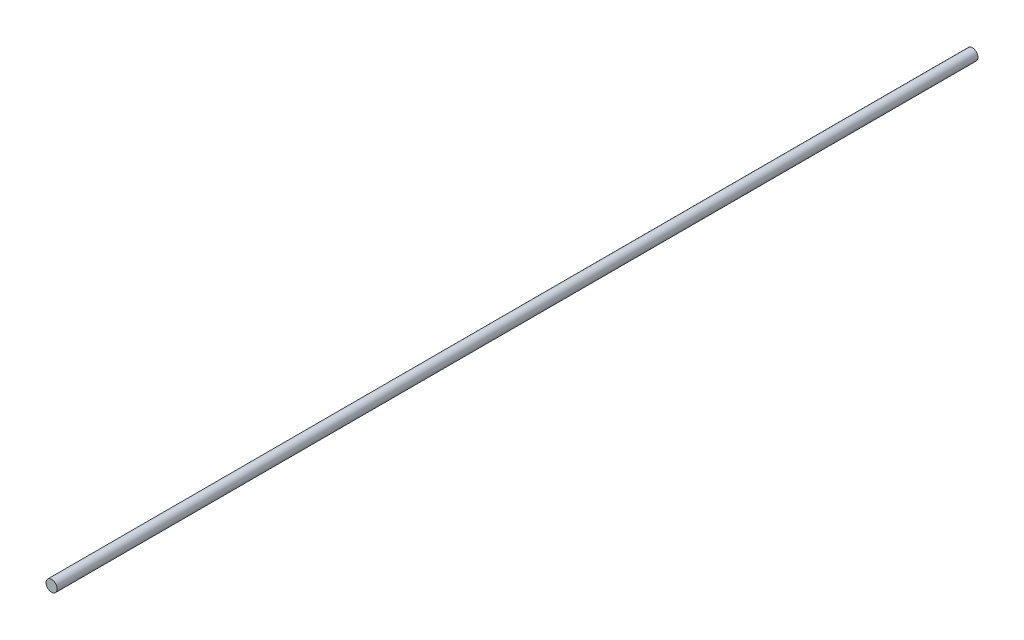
ISO-10303-21;
HEADER;
FILE_DESCRIPTION(('STEP AP214'),'2;1');
FILE_NAME('part.step','',(''),(''),'','','');
FILE_SCHEMA(('AUTOMOTIVE_DESIGN { 1 0 10303 214 1 1 1 1 }'));
ENDSEC;
DATA;
#1=APPLICATION_CONTEXT('core data for automotive mechanical design processes');
#2=APPLICATION_PROTOCOL_DEFINITION('international standard','automotive_design',2000,#1);
#3=PRODUCT_CONTEXT('',#1,'mechanical');
#4=PRODUCT('Part','Part','',(#3));
#5=PRODUCT_RELATED_PRODUCT_CATEGORY('part','',(#4));
#6=PRODUCT_DEFINITION_FORMATION('','',#4);
#7=PRODUCT_DEFINITION_CONTEXT('part definition',#1,'design');
#8=PRODUCT_DEFINITION('design','',#6,#7);
#9=PRODUCT_DEFINITION_SHAPE('','',#8);
#10=(LENGTH_UNIT() NAMED_UNIT(*) SI_UNIT(.MILLI.,.METRE.));
#11=(NAMED_UNIT(*) PLANE_ANGLE_UNIT() SI_UNIT($,.RADIAN.));
#12=(NAMED_UNIT(*) SI_UNIT($,.STERADIAN.) SOLID_ANGLE_UNIT());
#13=UNCERTAINTY_MEASURE_WITH_UNIT(LENGTH_MEASURE(1.E-05),#10,'distance_accuracy_value','');
#14=(GEOMETRIC_REPRESENTATION_CONTEXT(3) GLOBAL_UNCERTAINTY_ASSIGNED_CONTEXT((#13)) GLOBAL_UNIT_ASSIGNED_CONTEXT((#10,
#11,#12)) REPRESENTATION_CONTEXT('',''));
#15=CARTESIAN_POINT('',(0.,0.,0.));
#16=DIRECTION('',(0.,0.,1.));
#17=DIRECTION('',(1.,0.,0.));
#18=AXIS2_PLACEMENT_3D('',#15,#16,#17);
#19=CARTESIAN_POINT('',(0.,0.,-4950.));
#20=DIRECTION('',(0.,0.,1.));
#21=DIRECTION('',(1.,0.,0.));
#22=AXIS2_PLACEMENT_3D('',#19,#20,#21);
#23=CYLINDRICAL_SURFACE('',#22,30.);
#24=CARTESIAN_POINT('',(0.,0.,-4950.));
#25=DIRECTION('',(0.,0.,1.));
#26=DIRECTION('',(1.,0.,0.));
#27=AXIS2_PLACEMENT_3D('',#24,#25,#26);
#28=CIRCLE('',#27,30.);
#29=CARTESIAN_POINT('',(30.,0.,-4950.));
#30=VERTEX_POINT('',#29);
#31=EDGE_CURVE('E10',#30,#30,#28,.T.);
#32=ORIENTED_EDGE('',*,*,#31,.T.);
#33=EDGE_LOOP('',(#32));
#34=FACE_BOUND('',#33,.T.);
#35=CARTESIAN_POINT('',(0.,0.,0.));
#36=DIRECTION('',(0.,0.,1.));
#37=DIRECTION('',(1.,0.,0.));
#38=AXIS2_PLACEMENT_3D('',#35,#36,#37);
#39=CIRCLE('',#38,30.);
#40=CARTESIAN_POINT('',(30.,0.,0.));
#41=VERTEX_POINT('',#40);
#42=EDGE_CURVE('E40',#41,#41,#39,.T.);
#43=ORIENTED_EDGE('',*,*,#42,.F.);
#44=EDGE_LOOP('',(#43));
#45=FACE_BOUND('',#44,.T.);
#46=ADVANCED_FACE('F37',(#34,#45),#23,.T.);
#47=CARTESIAN_POINT('',(0.,0.,-4950.));
#48=DIRECTION('',(0.,0.,1.));
#49=DIRECTION('',(1.,0.,0.));
#50=AXIS2_PLACEMENT_3D('',#47,#48,#49);
#51=PLANE('',#50);
#52=ORIENTED_EDGE('',*,*,#31,.F.);
#53=EDGE_LOOP('',(#52));
#54=FACE_BOUND('',#53,.T.);
#55=ADVANCED_FACE('F54',(#54),#51,.F.);
#56=CARTESIAN_POINT('',(0.,0.,0.));
#57=DIRECTION('',(0.,0.,1.));
#58=DIRECTION('',(1.,0.,0.));
#59=AXIS2_PLACEMENT_3D('',#56,#57,#58);
#60=PLANE('',#59);
#61=ORIENTED_EDGE('',*,*,#42,.T.);
#62=EDGE_LOOP('',(#61));
#63=FACE_BOUND('',#62,.T.);
#64=ADVANCED_FACE('F51',(#63),#60,.T.);
#65=CLOSED_SHELL('',(#46,#55,#64));
#66=MANIFOLD_SOLID_BREP('B2',#65);
#67=ADVANCED_BREP_SHAPE_REPRESENTATION('',(#18,#66),#14);
#68=SHAPE_DEFINITION_REPRESENTATION(#9,#67);
ENDSEC;
END-ISO-10303-21;
